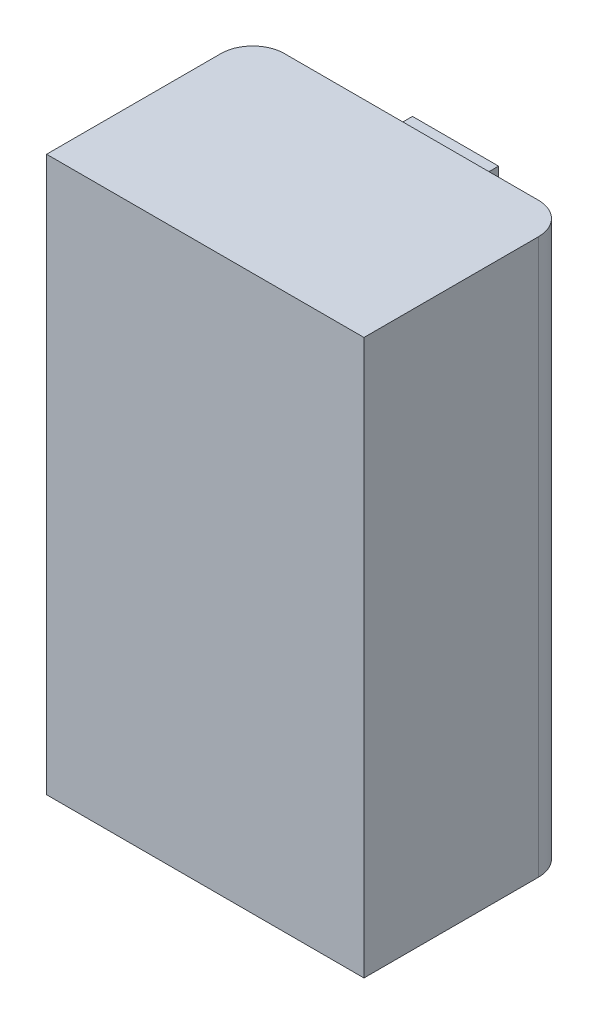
from build123d import *

# Parameters (mm, degrees)
SKETCH2_W           = 20.02592565
SKETCH2_H           = 13.003847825
BOSS_EXTRUDE1_DEPTH = 35
SKETCH4_W           = 14.816702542
SKETCH4_H           = 6.532804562
CUT_EXTRUDE1_DEPTH  = 6
FILLET1_R           = 2
BOSS_EXTRUDE2_DEPTH = 1.5


with BuildPart() as part:
    # Sketch2 → Boss-Extrude1 (new body)
    with BuildSketch(Plane(origin=(0, 0, 0), x_dir=(1, 0, 0), z_dir=(0, 1, 0))):
        with Locations((10.012962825, 6.501923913)):
            Rectangle(SKETCH2_W, SKETCH2_H)
    extrude(amount=BOSS_EXTRUDE1_DEPTH)

    # Sketch4 → Cut-Extrude1 (cut)
    with BuildSketch(Plane(origin=(0, 0, 0), x_dir=(-1, 0, 0), z_dir=(0, -1, 0))):
        with Locations((-10.016920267, 6.566876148)):
            Rectangle(SKETCH4_W, SKETCH4_H)
    extrude(amount=-CUT_EXTRUDE1_DEPTH, mode=Mode.SUBTRACT)

    # Fillet1
    fillet1_edges = [part.edges().sort_by_distance(p)[0] for p in [
        (0, 17.5, -13.003847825),
        (20.02592565, 17.5, -13.003847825),
    ]]
    fillet(fillet1_edges, radius=FILLET1_R)

    # Sketch5 → Boss-Extrude2 (add)
    # profile 1 of 4: a face of its own
    with BuildSketch(Plane(origin=(0, 0, -13.003847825), x_dir=(-1, 0, 0), z_dir=(0, 0, -1))):
        with BuildLine():
            Line((-14.015695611, 34.10669146), (-8.581401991, 34.10669146))
            Line((-8.581401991, 34.10669146), (-8.581401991, 30.88938492))
            add(Edge.make_bspline(
                [(-8.581401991, 30.88938492), (-8.583808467, 30.742353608), (-8.588508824, 30.455170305), (-8.626581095, 30.035594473), (-8.686815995, 29.63808396), (-8.774613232, 29.262985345), (-8.885524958, 28.909300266), (-9.022792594, 28.577912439), (-9.185602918, 28.2691009), (-9.340249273, 28.028995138), (-9.476440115, 27.852214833), (-9.578653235, 27.726830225), (-9.684249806, 27.610322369), (-9.794062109, 27.503497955), (-9.905330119, 27.40424544), (-10.019839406, 27.314545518), (-10.136307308, 27.232987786), (-10.255015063, 27.15900969), (-10.377735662, 27.095028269), (-10.503039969, 27.039677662), (-10.630402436, 26.990949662), (-10.760931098, 26.953233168), (-10.893606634, 26.922374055), (-11.029357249, 26.901888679), (-11.167624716, 26.888651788), (-11.260909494, 26.886741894), (-11.307854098, 26.885780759)],
                knots=[0, 0, 0, 0, 1.969308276, 3.846476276, 5.638853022, 7.350989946, 9.001834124, 10.599151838, 12.148782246, 13.672952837, 14.417780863, 15.137334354, 15.839584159, 16.522732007, 17.188703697, 17.836024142, 18.470017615, 19.092698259, 19.708342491, 20.322187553, 20.927045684, 21.533485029, 22.140791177, 22.750491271, 23.371197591, 24, 24, 24, 24], degree=3))
            add(Edge.make_bspline(
                [(-11.307854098, 26.885780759), (-11.354795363, 26.886764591), (-11.448073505, 26.888719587), (-11.586832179, 26.90166478), (-11.722920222, 26.923516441), (-11.856020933, 26.95543547), (-11.986197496, 26.994876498), (-12.114095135, 27.042444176), (-12.238080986, 27.100909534), (-12.359574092, 27.168070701), (-12.479569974, 27.241347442), (-12.594664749, 27.326853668), (-12.709583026, 27.417813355), (-12.818892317, 27.520738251), (-12.927257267, 27.630896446), (-13.032342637, 27.750203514), (-13.134761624, 27.878333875), (-13.233851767, 28.014870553), (-13.328986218, 28.159171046), (-13.417205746, 28.312157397), (-13.50004538, 28.471971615), (-13.57720753, 28.63939648), (-13.645722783, 28.815252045), (-13.712245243, 28.997256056), (-13.769803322, 29.187683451), (-13.820324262, 29.385907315), (-13.867562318, 29.59041391), (-13.906807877, 29.803174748), (-13.94012516, 30.023168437), (-13.968553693, 30.25076922), (-13.988952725, 30.485926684), (-14.00399379, 30.728714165), (-14.013501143, 30.978873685), (-14.014957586, 31.147986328), (-14.015695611, 31.23368092)],
                knots=[0, 0, 0, 0, 0.791994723, 1.573792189, 2.34921381, 3.115614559, 3.881316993, 4.643153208, 5.415782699, 6.191618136, 6.984908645, 7.785716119, 8.609182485, 9.456318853, 10.316763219, 11.215879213, 12.137419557, 13.083478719, 14.061456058, 15.052215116, 16.061652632, 17.097909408, 18.160852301, 19.245140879, 20.36675602, 21.515514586, 22.696239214, 23.907451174, 25.164795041, 26.450078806, 27.776766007, 29.146652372, 30.55412074, 32, 32, 32, 32], degree=3))
            Line((-14.015695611, 31.23368092), (-14.015695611, 34.10669146))
        make_face()
        with BuildLine():
            Line((-13.047944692, 32.320074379), (-13.047944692, 31.172033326))
            add(Edge.make_bspline(
                [(-13.047944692, 31.172033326), (-13.046668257, 31.088238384), (-13.044164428, 30.923868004), (-13.022632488, 30.68264226), (-12.988478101, 30.451238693), (-12.937934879, 30.230337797), (-12.875547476, 30.019010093), (-12.798719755, 29.817651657), (-12.706286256, 29.627187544), (-12.60295888, 29.446964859), (-12.485437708, 29.282411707), (-12.351491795, 29.139213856), (-12.204701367, 29.017017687), (-12.042912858, 28.91847568), (-11.868600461, 28.84103501), (-11.680321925, 28.786930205), (-11.478992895, 28.751734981), (-11.339802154, 28.748501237), (-11.268306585, 28.746840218)],
                knots=[0, 0, 0, 0, 1.1894114, 2.333124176, 3.435436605, 4.507723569, 5.547416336, 6.561483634, 7.563483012, 8.550063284, 9.507973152, 10.427061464, 11.326354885, 12.210922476, 13.107938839, 14.025856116, 14.985977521, 16, 16, 16, 16], degree=3))
            add(Edge.make_bspline(
                [(-11.268306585, 28.746840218), (-11.209627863, 28.74845717), (-11.093850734, 28.751647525), (-10.92414214, 28.782151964), (-10.760666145, 28.829554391), (-10.604742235, 28.898097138), (-10.453883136, 28.983044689), (-10.31201638, 29.090230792), (-10.17668441, 29.215849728), (-10.047948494, 29.357909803), (-9.931072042, 29.516886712), (-9.828071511, 29.689604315), (-9.742164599, 29.87585396), (-9.671013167, 30.073887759), (-9.616537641, 30.285009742), (-9.57725068, 30.508205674), (-9.553856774, 30.744267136), (-9.550746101, 30.905615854), (-9.54915291, 30.988253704)],
                knots=[0, 0, 0, 0, 0.893475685, 1.762888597, 2.619191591, 3.481953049, 4.352630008, 5.251948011, 6.184429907, 7.163397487, 8.169104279, 9.186511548, 10.222772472, 11.289972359, 12.389210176, 13.541344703, 14.740752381, 16, 16, 16, 16], degree=3))
            Line((-9.54915291, 30.988253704), (-9.54915291, 32.320074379))
            Line((-9.54915291, 32.320074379), (-13.047944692, 32.320074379))
        make_face(mode=Mode.SUBTRACT)
    # profile 2 of 4: a face of its own
    with BuildSketch(Plane(origin=(0, 0, -13.003847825), x_dir=(-1, 0, 0), z_dir=(0, 0, -1))):
        with BuildLine():
            Line((-8.581401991, 19.289637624), (-12.047625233, 19.289637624))
            add(Edge.make_bspline(
                [(-12.047625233, 19.289637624), (-12.103858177, 19.290706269), (-12.212956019, 19.292779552), (-12.372325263, 19.303778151), (-12.521689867, 19.325215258), (-12.66273399, 19.352275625), (-12.793457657, 19.38991206), (-12.915892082, 19.433380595), (-13.027390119, 19.487659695), (-13.132589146, 19.5484457), (-13.229948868, 19.622959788), (-13.322883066, 19.711668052), (-13.412098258, 19.815532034), (-13.498175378, 19.934753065), (-13.580695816, 20.069598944), (-13.660689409, 20.218957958), (-13.735969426, 20.384513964), (-13.809362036, 20.563224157), (-13.874829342, 20.75562118), (-13.93322173, 20.958110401), (-13.982126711, 21.170506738), (-14.020875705, 21.392332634), (-14.052890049, 21.623876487), (-14.074413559, 21.864927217), (-14.087308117, 22.115979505), (-14.08918225, 22.286315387), (-14.090137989, 22.373180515)],
                knots=[0, 0, 0, 0, 0.962463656, 1.867281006, 2.731508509, 3.543495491, 4.322752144, 5.057429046, 5.763753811, 6.441969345, 7.133364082, 7.856139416, 8.63700456, 9.473139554, 10.369892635, 11.340577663, 12.370759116, 13.480914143, 14.645473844, 15.846712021, 17.086048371, 18.373285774, 19.699205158, 21.085063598, 22.513488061, 24, 24, 24, 24], degree=3))
            add(Edge.make_bspline(
                [(-14.090137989, 22.373180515), (-14.089597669, 22.458493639), (-14.088538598, 22.625714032), (-14.076468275, 22.870486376), (-14.057963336, 23.104014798), (-14.033000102, 23.326091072), (-13.999132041, 23.536756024), (-13.958384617, 23.736223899), (-13.911530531, 23.924467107), (-13.855582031, 24.100717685), (-13.791962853, 24.264721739), (-13.72596332, 24.418837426), (-13.65052266, 24.559443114), (-13.572103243, 24.689934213), (-13.48538585, 24.806920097), (-13.395276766, 24.914349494), (-13.296313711, 25.006884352), (-13.194057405, 25.091070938), (-13.082809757, 25.161995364), (-12.966071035, 25.224954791), (-12.84134768, 25.277507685), (-12.710300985, 25.320586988), (-12.571558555, 25.352653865), (-12.426787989, 25.377441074), (-12.274326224, 25.391323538), (-12.170559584, 25.393035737), (-12.117414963, 25.393912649)],
                knots=[0, 0, 0, 0, 1.500050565, 2.940216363, 4.308128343, 5.618933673, 6.868690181, 8.058700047, 9.198003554, 10.278250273, 11.307644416, 12.290634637, 13.22387362, 14.11136395, 14.965003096, 15.782141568, 16.573003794, 17.343895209, 18.107881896, 18.888718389, 19.673829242, 20.484485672, 21.311322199, 22.175487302, 23.065566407, 24, 24, 24, 24], degree=3))
            Line((-12.117414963, 25.393912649), (-8.581401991, 25.393912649))
            Line((-8.581401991, 25.393912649), (-8.581401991, 23.607295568))
            Line((-8.581401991, 23.607295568), (-12.059256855, 23.607295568))
            add(Edge.make_bspline(
                [(-12.059256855, 23.607295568), (-12.112804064, 23.60581865), (-12.215588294, 23.602983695), (-12.362463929, 23.585437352), (-12.494325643, 23.552496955), (-12.612118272, 23.507979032), (-12.714234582, 23.44795012), (-12.802405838, 23.375936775), (-12.875801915, 23.290470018), (-12.949072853, 23.156035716), (-13.018701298, 22.970682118), (-13.07855313, 22.730908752), (-13.11693226, 22.471337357), (-13.120530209, 22.291512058), (-13.122387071, 22.198706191)],
                knots=[0, 0, 0, 0, 0.945593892, 1.815073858, 2.605384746, 3.340170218, 4.030530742, 4.68703654, 5.342685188, 6.004983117, 7.379206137, 8.827011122, 10.362455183, 12, 12, 12, 12], degree=3))
            add(Edge.make_bspline(
                [(-13.122387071, 22.198706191), (-13.121728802, 22.142472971), (-13.120442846, 22.032619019), (-13.110137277, 21.872639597), (-13.092135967, 21.721788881), (-13.070330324, 21.579992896), (-13.037704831, 21.447967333), (-13.001829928, 21.324052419), (-12.955567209, 21.210286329), (-12.905389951, 21.104172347), (-12.8442165, 21.009034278), (-12.768767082, 20.927004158), (-12.681680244, 20.856850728), (-12.580578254, 20.800955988), (-12.46826946, 20.755908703), (-12.342569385, 20.727595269), (-12.205381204, 20.706122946), (-12.109371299, 20.70475621), (-12.059256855, 20.704042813)],
                knots=[0, 0, 0, 0, 1.27923955, 2.499048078, 3.644553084, 4.735012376, 5.759780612, 6.736424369, 7.666762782, 8.550394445, 9.404203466, 10.228337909, 11.075514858, 11.936537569, 12.847225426, 13.818477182, 14.861307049, 16, 16, 16, 16], degree=3))
            Line((-12.059256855, 20.704042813), (-8.581401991, 20.704042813))
            Line((-8.581401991, 20.704042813), (-8.581401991, 19.289637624))
        make_face()
    # profile 3 of 4: a face of its own
    with BuildSketch(Plane(origin=(0, 0, -13.003847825), x_dir=(-1, 0, 0), z_dir=(0, 0, -1))):
        Polygon((-14.015695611, 13.777881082), (-14.015695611, 15.638940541), (-11.73938726, 15.638940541), (-8.581401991, 18.542193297), (-8.581401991, 16.522943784), (-10.719294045, 14.552547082), (-8.581401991, 12.733361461), (-8.581401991, 11.097955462), (-11.716124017, 13.777881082), align=None)
    # profile 4 of 4: a face of its own
    with BuildSketch(Plane(origin=(0, 0, -13.003847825), x_dir=(-1, 0, 0), z_dir=(0, 0, -1))):
        with BuildLine():
            Line((-13.047944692, 0.669981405), (-14.015695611, 0.669981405))
            Line((-14.015695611, 0.669981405), (-14.015695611, 7.2209107))
            Line((-14.015695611, 7.2209107), (-12.99792872, 7.2209107))
            Line((-12.99792872, 7.2209107), (-11.891761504, 4.495621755))
            add(Edge.make_bspline(
                [(-11.891761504, 4.495621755), (-11.850699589, 4.396572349), (-11.771946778, 4.206605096), (-11.651781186, 3.935875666), (-11.536184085, 3.690954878), (-11.424251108, 3.471316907), (-11.317220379, 3.276951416), (-11.212258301, 3.109189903), (-11.113064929, 2.96593292), (-11.015175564, 2.848170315), (-10.920395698, 2.74973731), (-10.828680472, 2.666792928), (-10.741300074, 2.59409245), (-10.655278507, 2.536252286), (-10.572058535, 2.489527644), (-10.491215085, 2.456869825), (-10.412390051, 2.436919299), (-10.360756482, 2.433733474), (-10.335450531, 2.43217208)],
                knots=[0, 0, 0, 0, 1.913035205, 3.669017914, 5.28429847, 6.744586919, 8.066912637, 9.241630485, 10.27421035, 11.173227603, 11.970693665, 12.710118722, 13.378892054, 13.996707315, 14.557089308, 15.078635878, 15.548433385, 16, 16, 16, 16], degree=3))
            add(Edge.make_bspline(
                [(-10.335450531, 2.43217208), (-10.306271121, 2.43317922), (-10.248459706, 2.435174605), (-10.163654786, 2.454589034), (-10.08231293, 2.486626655), (-10.004290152, 2.530819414), (-9.930532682, 2.588528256), (-9.857338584, 2.655370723), (-9.790972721, 2.73840753), (-9.725678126, 2.830541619), (-9.666702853, 2.933685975), (-9.616057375, 3.045810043), (-9.571150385, 3.165212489), (-9.53535668, 3.292831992), (-9.508985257, 3.429111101), (-9.489714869, 3.572817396), (-9.475926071, 3.724568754), (-9.47512229, 3.828321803), (-9.474710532, 3.881472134)],
                knots=[0, 0, 0, 0, 0.754052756, 1.493959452, 2.237258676, 3.009965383, 3.804504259, 4.656200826, 5.568154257, 6.547780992, 7.576807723, 8.63619289, 9.728136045, 10.874614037, 12.06095286, 13.316527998, 14.625318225, 16, 16, 16, 16], degree=3))
            add(Edge.make_bspline(
                [(-9.474710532, 3.881472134), (-9.475681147, 3.936161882), (-9.477576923, 4.042980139), (-9.490061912, 4.198849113), (-9.512333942, 4.345644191), (-9.542118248, 4.483874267), (-9.581804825, 4.612889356), (-9.629281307, 4.733877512), (-9.686839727, 4.845612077), (-9.751141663, 4.94990046), (-9.826877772, 5.043280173), (-9.909745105, 5.129066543), (-10.001792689, 5.205839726), (-10.102880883, 5.273756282), (-10.212275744, 5.333054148), (-10.330645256, 5.383305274), (-10.457741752, 5.423909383), (-10.546199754, 5.44387665), (-10.591346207, 5.454067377)],
                knots=[0, 0, 0, 0, 1.236572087, 2.415232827, 3.532298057, 4.591556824, 5.609262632, 6.581117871, 7.525989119, 8.447805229, 9.345931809, 10.238651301, 11.141088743, 12.050440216, 12.987962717, 13.950281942, 14.953882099, 16, 16, 16, 16], degree=3))
            Line((-10.591346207, 5.454067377), (-10.35638745, 7.2209107))
            add(Edge.make_bspline(
                [(-10.35638745, 7.2209107), (-10.28963582, 7.203767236), (-10.156443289, 7.16956011), (-9.964892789, 7.092025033), (-9.78346436, 6.991663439), (-9.610234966, 6.871886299), (-9.448336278, 6.728316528), (-9.295061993, 6.564549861), (-9.152332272, 6.378560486), (-9.018926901, 6.173067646), (-8.897574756, 5.948713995), (-8.794015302, 5.706012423), (-8.703169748, 5.448053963), (-8.632559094, 5.172581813), (-8.57471529, 4.88149426), (-8.536638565, 4.573189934), (-8.511268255, 4.249070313), (-8.508416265, 4.027306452), (-8.506959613, 3.914040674)],
                knots=[0, 0, 0, 0, 0.808007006, 1.612252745, 2.416472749, 3.236783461, 4.078168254, 4.950423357, 5.864945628, 6.825215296, 7.822603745, 8.853652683, 9.918337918, 11.028417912, 12.18739688, 13.398346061, 14.671206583, 16, 16, 16, 16], degree=3))
            add(Edge.make_bspline(
                [(-8.506959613, 3.914040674), (-8.508423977, 3.793800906), (-8.51128031, 3.559265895), (-8.536359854, 3.216469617), (-8.575812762, 2.891566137), (-8.634584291, 2.585311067), (-8.706789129, 2.296424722), (-8.798055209, 2.026579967), (-8.90302459, 1.773642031), (-9.026252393, 1.542419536), (-9.159789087, 1.333283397), (-9.303480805, 1.150509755), (-9.454308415, 0.993602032), (-9.616099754, 0.867219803), (-9.785357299, 0.767082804), (-9.963662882, 0.697309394), (-10.150308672, 0.653179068), (-10.27782198, 0.648118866), (-10.342429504, 0.645555)],
                knots=[0, 0, 0, 0, 1.398817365, 2.72847869, 3.996958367, 5.204645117, 6.354576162, 7.458733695, 8.516089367, 9.537208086, 10.50322941, 11.399408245, 12.238399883, 13.028922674, 13.780975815, 14.518161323, 15.249192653, 16, 16, 16, 16], degree=3))
            add(Edge.make_bspline(
                [(-10.342429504, 0.645555), (-10.399606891, 0.647719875), (-10.513945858, 0.652049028), (-10.682585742, 0.689448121), (-10.846033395, 0.751236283), (-11.005379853, 0.835628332), (-11.159707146, 0.945138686), (-11.308580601, 1.079358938), (-11.454374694, 1.235678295), (-11.570231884, 1.385399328), (-11.66153149, 1.522990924), (-11.7347724, 1.643905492), (-11.809870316, 1.781755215), (-11.88937586, 1.935347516), (-11.970275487, 2.106286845), (-12.053651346, 2.293927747), (-12.141458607, 2.497502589), (-12.22991875, 2.718363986), (-12.323831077, 2.954788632), (-12.418715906, 3.208192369), (-12.516214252, 3.47827377), (-12.617483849, 3.76477964), (-12.722488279, 4.067622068), (-12.827594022, 4.388011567), (-12.937186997, 4.724084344), (-13.010466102, 4.953865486), (-13.047944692, 5.071387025)],
                knots=[0, 0, 0, 0, 0.751860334, 1.503512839, 2.260825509, 3.046075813, 3.870048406, 4.744716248, 5.679829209, 6.680115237, 7.232078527, 7.852558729, 8.540012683, 9.297720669, 10.128554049, 11.028533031, 12.000096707, 13.046241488, 14.159668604, 15.348195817, 16.607279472, 17.938785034, 19.34760204, 20.825735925, 22.376523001, 24, 24, 24, 24], degree=3))
            Line((-13.047944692, 5.071387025), (-13.047944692, 0.669981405))
        make_face()
    extrude(amount=BOSS_EXTRUDE2_DEPTH)


solid = part.part
